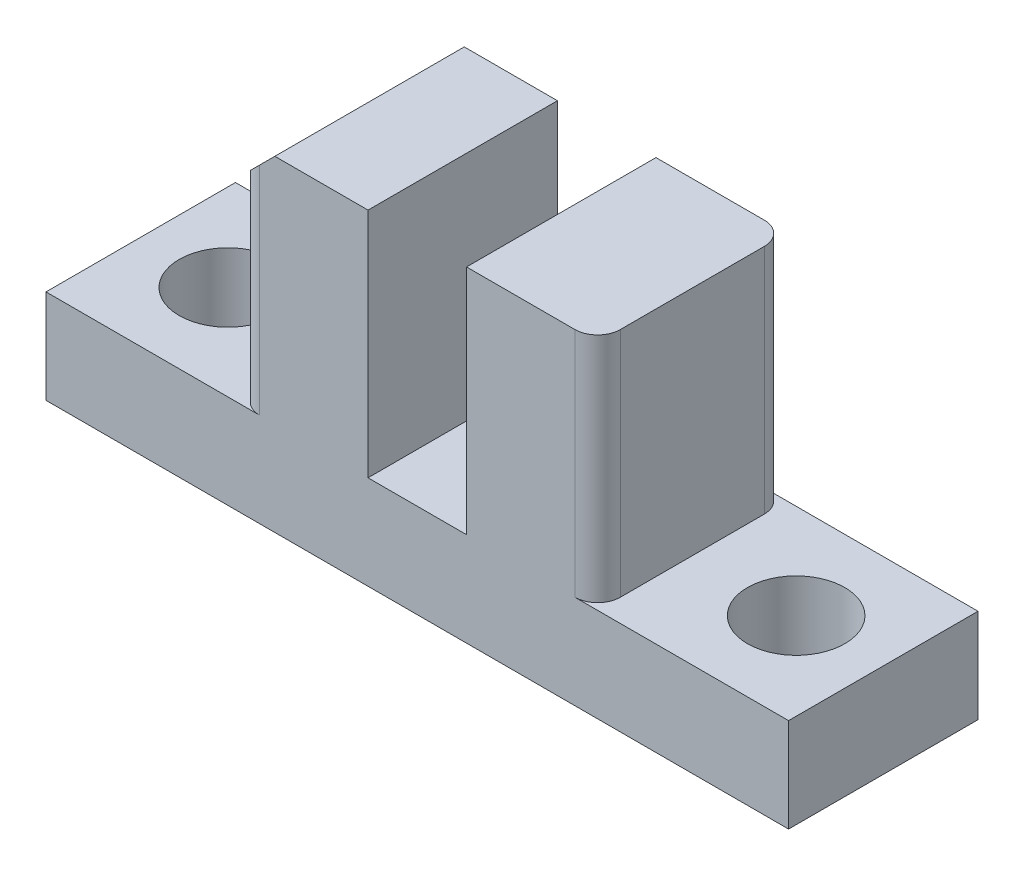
ISO-10303-21;
HEADER;
FILE_DESCRIPTION(('STEP AP214'),'2;1');
FILE_NAME('part.step','',(''),(''),'','','');
FILE_SCHEMA(('AUTOMOTIVE_DESIGN { 1 0 10303 214 1 1 1 1 }'));
ENDSEC;
DATA;
#1=APPLICATION_CONTEXT('core data for automotive mechanical design processes');
#2=APPLICATION_PROTOCOL_DEFINITION('international standard','automotive_design',2000,#1);
#3=PRODUCT_CONTEXT('',#1,'mechanical');
#4=PRODUCT('Part','Part','',(#3));
#5=PRODUCT_RELATED_PRODUCT_CATEGORY('part','',(#4));
#6=PRODUCT_DEFINITION_FORMATION('','',#4);
#7=PRODUCT_DEFINITION_CONTEXT('part definition',#1,'design');
#8=PRODUCT_DEFINITION('design','',#6,#7);
#9=PRODUCT_DEFINITION_SHAPE('','',#8);
#10=(LENGTH_UNIT() NAMED_UNIT(*) SI_UNIT(.MILLI.,.METRE.));
#11=(NAMED_UNIT(*) PLANE_ANGLE_UNIT() SI_UNIT($,.RADIAN.));
#12=(NAMED_UNIT(*) SI_UNIT($,.STERADIAN.) SOLID_ANGLE_UNIT());
#13=UNCERTAINTY_MEASURE_WITH_UNIT(LENGTH_MEASURE(1.E-05),#10,'distance_accuracy_value','');
#14=(GEOMETRIC_REPRESENTATION_CONTEXT(3) GLOBAL_UNCERTAINTY_ASSIGNED_CONTEXT((#13)) GLOBAL_UNIT_ASSIGNED_CONTEXT((#10,
#11,#12)) REPRESENTATION_CONTEXT('',''));
#15=CARTESIAN_POINT('',(0.,0.,0.));
#16=DIRECTION('',(0.,0.,1.));
#17=DIRECTION('',(1.,0.,0.));
#18=AXIS2_PLACEMENT_3D('',#15,#16,#17);
#19=CARTESIAN_POINT('',(-6.04519999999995,10.922,6.35));
#20=DIRECTION('',(1.,0.,0.));
#21=DIRECTION('',(0.,1.,0.));
#22=AXIS2_PLACEMENT_3D('',#19,#20,#21);
#23=PLANE('',#22);
#24=DIRECTION('',(0.,0.,-1.));
#25=VECTOR('',#24,1.);
#26=CARTESIAN_POINT('',(-6.04519999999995,9.65199999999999,6.35));
#27=LINE('',#26,#25);
#28=CARTESIAN_POINT('',(-6.04519999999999,9.65199999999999,5.588));
#29=VERTEX_POINT('',#28);
#30=CARTESIAN_POINT('',(-6.0452,9.65199999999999,0.762));
#31=VERTEX_POINT('',#30);
#32=EDGE_CURVE('E237',#29,#31,#27,.T.);
#33=ORIENTED_EDGE('',*,*,#32,.T.);
#34=DIRECTION('',(0.,-1.,0.));
#35=VECTOR('',#34,1.);
#36=CARTESIAN_POINT('',(-6.0452,10.922,0.762));
#37=LINE('',#36,#35);
#38=CARTESIAN_POINT('',(-6.0452,3.1496,0.762000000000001));
#39=VERTEX_POINT('',#38);
#40=EDGE_CURVE('E266',#31,#39,#37,.T.);
#41=ORIENTED_EDGE('',*,*,#40,.T.);
#42=DIRECTION('',(0.,0.,-1.));
#43=VECTOR('',#42,1.);
#44=CARTESIAN_POINT('',(-6.04519999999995,3.1496,6.35));
#45=LINE('',#44,#43);
#46=CARTESIAN_POINT('',(-6.04519999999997,3.1496,5.588));
#47=VERTEX_POINT('',#46);
#48=EDGE_CURVE('E165',#47,#39,#45,.T.);
#49=ORIENTED_EDGE('',*,*,#48,.F.);
#50=DIRECTION('',(0.,-1.,0.));
#51=VECTOR('',#50,1.);
#52=CARTESIAN_POINT('',(-6.04519999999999,9.65200000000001,5.588));
#53=LINE('',#52,#51);
#54=EDGE_CURVE('E264',#47,#29,#53,.F.);
#55=ORIENTED_EDGE('',*,*,#54,.T.);
#56=EDGE_LOOP('',(#33,#41,#49,#55));
#57=FACE_BOUND('',#56,.T.);
#58=ADVANCED_FACE('F30',(#57),#23,.F.);
#59=CARTESIAN_POINT('',(-12.4459999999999,3.1496,6.35));
#60=DIRECTION('',(0.,-1.,0.));
#61=DIRECTION('',(0.,0.,-1.));
#62=AXIS2_PLACEMENT_3D('',#59,#60,#61);
#63=PLANE('',#62);
#64=CARTESIAN_POINT('',(-9.52499999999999,3.1496,3.175));
#65=DIRECTION('',(0.,1.,0.));
#66=DIRECTION('',(0.,0.,1.));
#67=AXIS2_PLACEMENT_3D('',#64,#65,#66);
#68=CIRCLE('',#67,1.63194999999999);
#69=CARTESIAN_POINT('',(-9.52499999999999,3.1496,4.80694999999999));
#70=VERTEX_POINT('',#69);
#71=EDGE_CURVE('E523',#70,#70,#68,.T.);
#72=ORIENTED_EDGE('',*,*,#71,.F.);
#73=EDGE_LOOP('',(#72));
#74=FACE_BOUND('',#73,.T.);
#75=DIRECTION('',(-1.,0.,0.));
#76=VECTOR('',#75,1.);
#77=CARTESIAN_POINT('',(-12.446,3.1496,0.));
#78=LINE('',#77,#76);
#79=CARTESIAN_POINT('',(-5.2832,3.1496,0.));
#80=VERTEX_POINT('',#79);
#81=CARTESIAN_POINT('',(-12.446,3.1496,0.));
#82=VERTEX_POINT('',#81);
#83=EDGE_CURVE('E162',#80,#82,#78,.T.);
#84=ORIENTED_EDGE('',*,*,#83,.T.);
#85=DIRECTION('',(0.,0.,-1.));
#86=VECTOR('',#85,1.);
#87=CARTESIAN_POINT('',(-12.4459999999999,3.1496,6.35));
#88=LINE('',#87,#86);
#89=CARTESIAN_POINT('',(-12.4459999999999,3.1496,6.35));
#90=VERTEX_POINT('',#89);
#91=EDGE_CURVE('E160',#90,#82,#88,.T.);
#92=ORIENTED_EDGE('',*,*,#91,.F.);
#93=DIRECTION('',(-1.,0.,0.));
#94=VECTOR('',#93,1.);
#95=CARTESIAN_POINT('',(-12.4459999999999,3.1496,6.35));
#96=LINE('',#95,#94);
#97=CARTESIAN_POINT('',(-5.28319999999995,3.1496,6.35));
#98=VERTEX_POINT('',#97);
#99=EDGE_CURVE('E148',#98,#90,#96,.T.);
#100=ORIENTED_EDGE('',*,*,#99,.F.);
#101=CARTESIAN_POINT('',(-5.28319999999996,3.1496,5.588));
#102=DIRECTION('',(0.,-1.,0.));
#103=DIRECTION('',(0.,0.,-1.));
#104=AXIS2_PLACEMENT_3D('',#101,#102,#103);
#105=CIRCLE('',#104,0.762);
#106=EDGE_CURVE('E11',#98,#47,#105,.T.);
#107=ORIENTED_EDGE('',*,*,#106,.T.);
#108=ORIENTED_EDGE('',*,*,#48,.T.);
#109=CARTESIAN_POINT('',(-5.2832,3.1496,0.762));
#110=DIRECTION('',(0.,-1.,0.));
#111=DIRECTION('',(0.,0.,-1.));
#112=AXIS2_PLACEMENT_3D('',#109,#110,#111);
#113=CIRCLE('',#112,0.762);
#114=EDGE_CURVE('E38',#39,#80,#113,.T.);
#115=ORIENTED_EDGE('',*,*,#114,.T.);
#116=EDGE_LOOP('',(#84,#92,#100,#107,#108,#115));
#117=FACE_BOUND('',#116,.T.);
#118=ADVANCED_FACE('F161',(#74,#117),#63,.F.);
#119=CARTESIAN_POINT('',(-12.4459999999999,0.,6.35));
#120=DIRECTION('',(1.,0.,0.));
#121=DIRECTION('',(0.,0.,-1.));
#122=AXIS2_PLACEMENT_3D('',#119,#120,#121);
#123=PLANE('',#122);
#124=DIRECTION('',(0.,-1.,0.));
#125=VECTOR('',#124,1.);
#126=CARTESIAN_POINT('',(-12.446,0.,0.));
#127=LINE('',#126,#125);
#128=CARTESIAN_POINT('',(-12.446,0.,0.));
#129=VERTEX_POINT('',#128);
#130=EDGE_CURVE('E193',#82,#129,#127,.T.);
#131=ORIENTED_EDGE('',*,*,#130,.T.);
#132=DIRECTION('',(0.,0.,-1.));
#133=VECTOR('',#132,1.);
#134=CARTESIAN_POINT('',(-12.4459999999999,0.,6.35));
#135=LINE('',#134,#133);
#136=CARTESIAN_POINT('',(-12.4459999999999,0.,6.35));
#137=VERTEX_POINT('',#136);
#138=EDGE_CURVE('E166',#137,#129,#135,.T.);
#139=ORIENTED_EDGE('',*,*,#138,.F.);
#140=DIRECTION('',(0.,-1.,0.));
#141=VECTOR('',#140,1.);
#142=CARTESIAN_POINT('',(-12.4459999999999,0.,6.35));
#143=LINE('',#142,#141);
#144=EDGE_CURVE('E152',#90,#137,#143,.T.);
#145=ORIENTED_EDGE('',*,*,#144,.F.);
#146=ORIENTED_EDGE('',*,*,#91,.T.);
#147=EDGE_LOOP('',(#131,#139,#145,#146));
#148=FACE_BOUND('',#147,.T.);
#149=ADVANCED_FACE('F168',(#148),#123,.F.);
#150=CARTESIAN_POINT('',(-12.4459999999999,0.,6.35));
#151=DIRECTION('',(0.,1.,0.));
#152=DIRECTION('',(0.,0.,1.));
#153=AXIS2_PLACEMENT_3D('',#150,#151,#152);
#154=PLANE('',#153);
#155=CARTESIAN_POINT('',(-9.52499999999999,0.,3.175));
#156=DIRECTION('',(0.,1.,0.));
#157=DIRECTION('',(0.,0.,1.));
#158=AXIS2_PLACEMENT_3D('',#155,#156,#157);
#159=CIRCLE('',#158,1.63195);
#160=CARTESIAN_POINT('',(-9.52499999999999,0.,4.80695));
#161=VERTEX_POINT('',#160);
#162=EDGE_CURVE('E520',#161,#161,#159,.T.);
#163=ORIENTED_EDGE('',*,*,#162,.T.);
#164=EDGE_LOOP('',(#163));
#165=FACE_BOUND('',#164,.T.);
#166=CARTESIAN_POINT('',(9.52500000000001,0.,3.175));
#167=DIRECTION('',(0.,1.,0.));
#168=DIRECTION('',(0.,0.,1.));
#169=AXIS2_PLACEMENT_3D('',#166,#167,#168);
#170=CIRCLE('',#169,1.63195);
#171=CARTESIAN_POINT('',(9.52500000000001,0.,4.80695));
#172=VERTEX_POINT('',#171);
#173=EDGE_CURVE('E194',#172,#172,#170,.T.);
#174=ORIENTED_EDGE('',*,*,#173,.T.);
#175=EDGE_LOOP('',(#174));
#176=FACE_BOUND('',#175,.T.);
#177=DIRECTION('',(1.,0.,0.));
#178=VECTOR('',#177,1.);
#179=CARTESIAN_POINT('',(-12.446,0.,0.));
#180=LINE('',#179,#178);
#181=CARTESIAN_POINT('',(12.446,0.,0.));
#182=VERTEX_POINT('',#181);
#183=EDGE_CURVE('E196',#129,#182,#180,.T.);
#184=ORIENTED_EDGE('',*,*,#183,.T.);
#185=DIRECTION('',(0.,0.,-1.));
#186=VECTOR('',#185,1.);
#187=CARTESIAN_POINT('',(12.4460000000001,0.,6.35));
#188=LINE('',#187,#186);
#189=CARTESIAN_POINT('',(12.4460000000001,0.,6.35));
#190=VERTEX_POINT('',#189);
#191=EDGE_CURVE('E232',#190,#182,#188,.T.);
#192=ORIENTED_EDGE('',*,*,#191,.F.);
#193=DIRECTION('',(1.,0.,0.));
#194=VECTOR('',#193,1.);
#195=CARTESIAN_POINT('',(-12.4459999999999,0.,6.35));
#196=LINE('',#195,#194);
#197=EDGE_CURVE('E171',#137,#190,#196,.T.);
#198=ORIENTED_EDGE('',*,*,#197,.F.);
#199=ORIENTED_EDGE('',*,*,#138,.T.);
#200=EDGE_LOOP('',(#184,#192,#198,#199));
#201=FACE_BOUND('',#200,.T.);
#202=ADVANCED_FACE('F336',(#165,#176,#201),#154,.F.);
#203=CARTESIAN_POINT('',(12.4460000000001,0.,6.35));
#204=DIRECTION('',(-1.,0.,0.));
#205=DIRECTION('',(0.,0.,1.));
#206=AXIS2_PLACEMENT_3D('',#203,#204,#205);
#207=PLANE('',#206);
#208=DIRECTION('',(0.,1.,0.));
#209=VECTOR('',#208,1.);
#210=CARTESIAN_POINT('',(12.446,0.,0.));
#211=LINE('',#210,#209);
#212=CARTESIAN_POINT('',(12.446,3.1496,0.));
#213=VERTEX_POINT('',#212);
#214=EDGE_CURVE('E198',#182,#213,#211,.T.);
#215=ORIENTED_EDGE('',*,*,#214,.T.);
#216=DIRECTION('',(0.,0.,-1.));
#217=VECTOR('',#216,1.);
#218=CARTESIAN_POINT('',(12.4460000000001,3.1496,6.35));
#219=LINE('',#218,#217);
#220=CARTESIAN_POINT('',(12.4460000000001,3.1496,6.35));
#221=VERTEX_POINT('',#220);
#222=EDGE_CURVE('E229',#221,#213,#219,.T.);
#223=ORIENTED_EDGE('',*,*,#222,.F.);
#224=DIRECTION('',(0.,1.,0.));
#225=VECTOR('',#224,1.);
#226=CARTESIAN_POINT('',(12.4460000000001,0.,6.35));
#227=LINE('',#226,#225);
#228=EDGE_CURVE('E173',#190,#221,#227,.T.);
#229=ORIENTED_EDGE('',*,*,#228,.F.);
#230=ORIENTED_EDGE('',*,*,#191,.T.);
#231=EDGE_LOOP('',(#215,#223,#229,#230));
#232=FACE_BOUND('',#231,.T.);
#233=ADVANCED_FACE('F332',(#232),#207,.F.);
#234=CARTESIAN_POINT('',(6.04520000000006,3.1496,6.35));
#235=DIRECTION('',(0.,-1.,0.));
#236=DIRECTION('',(0.,0.,-1.));
#237=AXIS2_PLACEMENT_3D('',#234,#235,#236);
#238=PLANE('',#237);
#239=CARTESIAN_POINT('',(9.52500000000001,3.1496,3.175));
#240=DIRECTION('',(0.,1.,0.));
#241=DIRECTION('',(0.,0.,1.));
#242=AXIS2_PLACEMENT_3D('',#239,#240,#241);
#243=CIRCLE('',#242,1.63194999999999);
#244=CARTESIAN_POINT('',(9.52500000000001,3.1496,4.80694999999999));
#245=VERTEX_POINT('',#244);
#246=EDGE_CURVE('E518',#245,#245,#243,.T.);
#247=ORIENTED_EDGE('',*,*,#246,.F.);
#248=EDGE_LOOP('',(#247));
#249=FACE_BOUND('',#248,.T.);
#250=DIRECTION('',(-1.,0.,0.));
#251=VECTOR('',#250,1.);
#252=CARTESIAN_POINT('',(6.0452,3.1496,0.));
#253=LINE('',#252,#251);
#254=CARTESIAN_POINT('',(5.2832,3.1496,0.));
#255=VERTEX_POINT('',#254);
#256=EDGE_CURVE('E200',#213,#255,#253,.T.);
#257=ORIENTED_EDGE('',*,*,#256,.T.);
#258=CARTESIAN_POINT('',(5.2832,3.1496,0.762));
#259=DIRECTION('',(0.,-1.,0.));
#260=DIRECTION('',(0.,0.,-1.));
#261=AXIS2_PLACEMENT_3D('',#258,#259,#260);
#262=CIRCLE('',#261,0.762);
#263=CARTESIAN_POINT('',(6.0452,3.1496,0.762));
#264=VERTEX_POINT('',#263);
#265=EDGE_CURVE('E272',#255,#264,#262,.T.);
#266=ORIENTED_EDGE('',*,*,#265,.T.);
#267=DIRECTION('',(0.,0.,-1.));
#268=VECTOR('',#267,1.);
#269=CARTESIAN_POINT('',(6.04520000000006,3.1496,6.35));
#270=LINE('',#269,#268);
#271=CARTESIAN_POINT('',(6.04520000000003,3.1496,5.588));
#272=VERTEX_POINT('',#271);
#273=EDGE_CURVE('E226',#272,#264,#270,.T.);
#274=ORIENTED_EDGE('',*,*,#273,.F.);
#275=CARTESIAN_POINT('',(5.28320000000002,3.1496,5.588));
#276=DIRECTION('',(0.,-1.,0.));
#277=DIRECTION('',(0.,0.,-1.));
#278=AXIS2_PLACEMENT_3D('',#275,#276,#277);
#279=CIRCLE('',#278,0.762);
#280=CARTESIAN_POINT('',(5.28320000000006,3.1496,6.35));
#281=VERTEX_POINT('',#280);
#282=EDGE_CURVE('E274',#272,#281,#279,.T.);
#283=ORIENTED_EDGE('',*,*,#282,.T.);
#284=DIRECTION('',(-1.,0.,0.));
#285=VECTOR('',#284,1.);
#286=CARTESIAN_POINT('',(6.04520000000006,3.1496,6.35));
#287=LINE('',#286,#285);
#288=EDGE_CURVE('E178',#221,#281,#287,.T.);
#289=ORIENTED_EDGE('',*,*,#288,.F.);
#290=ORIENTED_EDGE('',*,*,#222,.T.);
#291=EDGE_LOOP('',(#257,#266,#274,#283,#289,#290));
#292=FACE_BOUND('',#291,.T.);
#293=ADVANCED_FACE('F318',(#249,#292),#238,.F.);
#294=CARTESIAN_POINT('',(6.04520000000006,10.922,6.35));
#295=DIRECTION('',(-1.,0.,0.));
#296=DIRECTION('',(0.,-1.,0.));
#297=AXIS2_PLACEMENT_3D('',#294,#295,#296);
#298=PLANE('',#297);
#299=ORIENTED_EDGE('',*,*,#273,.T.);
#300=DIRECTION('',(0.,1.,0.));
#301=VECTOR('',#300,1.);
#302=CARTESIAN_POINT('',(6.0452,10.922,0.762000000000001));
#303=LINE('',#302,#301);
#304=CARTESIAN_POINT('',(6.0452,10.922,0.762000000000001));
#305=VERTEX_POINT('',#304);
#306=EDGE_CURVE('E248',#264,#305,#303,.T.);
#307=ORIENTED_EDGE('',*,*,#306,.T.);
#308=DIRECTION('',(0.,0.,-1.));
#309=VECTOR('',#308,1.);
#310=CARTESIAN_POINT('',(6.04520000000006,10.922,6.35));
#311=LINE('',#310,#309);
#312=CARTESIAN_POINT('',(6.0452,10.922,5.588));
#313=VERTEX_POINT('',#312);
#314=EDGE_CURVE('E223',#313,#305,#311,.T.);
#315=ORIENTED_EDGE('',*,*,#314,.F.);
#316=DIRECTION('',(0.,1.,0.));
#317=VECTOR('',#316,1.);
#318=CARTESIAN_POINT('',(6.04520000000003,3.1496,5.588));
#319=LINE('',#318,#317);
#320=EDGE_CURVE('E246',#313,#272,#319,.F.);
#321=ORIENTED_EDGE('',*,*,#320,.T.);
#322=EDGE_LOOP('',(#299,#307,#315,#321));
#323=FACE_BOUND('',#322,.T.);
#324=ADVANCED_FACE('F321',(#323),#298,.F.);
#325=CARTESIAN_POINT('',(1.65100000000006,10.922,6.35));
#326=DIRECTION('',(0.,-1.,0.));
#327=DIRECTION('',(0.,0.,-1.));
#328=AXIS2_PLACEMENT_3D('',#325,#326,#327);
#329=PLANE('',#328);
#330=ORIENTED_EDGE('',*,*,#314,.T.);
#331=CARTESIAN_POINT('',(5.2832,10.922,0.762));
#332=DIRECTION('',(0.,-1.,0.));
#333=DIRECTION('',(0.,0.,-1.));
#334=AXIS2_PLACEMENT_3D('',#331,#332,#333);
#335=CIRCLE('',#334,0.762);
#336=CARTESIAN_POINT('',(5.2832,10.922,0.));
#337=VERTEX_POINT('',#336);
#338=EDGE_CURVE('E253',#305,#337,#335,.F.);
#339=ORIENTED_EDGE('',*,*,#338,.T.);
#340=DIRECTION('',(-1.,0.,0.));
#341=VECTOR('',#340,1.);
#342=CARTESIAN_POINT('',(1.651,10.922,0.));
#343=LINE('',#342,#341);
#344=CARTESIAN_POINT('',(1.651,10.922,0.));
#345=VERTEX_POINT('',#344);
#346=EDGE_CURVE('E202',#337,#345,#343,.T.);
#347=ORIENTED_EDGE('',*,*,#346,.T.);
#348=DIRECTION('',(0.,0.,-1.));
#349=VECTOR('',#348,1.);
#350=CARTESIAN_POINT('',(1.65100000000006,10.922,6.35));
#351=LINE('',#350,#349);
#352=CARTESIAN_POINT('',(1.65100000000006,10.922,6.35));
#353=VERTEX_POINT('',#352);
#354=EDGE_CURVE('E220',#353,#345,#351,.T.);
#355=ORIENTED_EDGE('',*,*,#354,.F.);
#356=DIRECTION('',(-1.,0.,0.));
#357=VECTOR('',#356,1.);
#358=CARTESIAN_POINT('',(1.65100000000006,10.922,6.35));
#359=LINE('',#358,#357);
#360=CARTESIAN_POINT('',(5.28320000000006,10.922,6.35));
#361=VERTEX_POINT('',#360);
#362=EDGE_CURVE('E180',#361,#353,#359,.T.);
#363=ORIENTED_EDGE('',*,*,#362,.F.);
#364=CARTESIAN_POINT('',(5.2832,10.922,5.588));
#365=DIRECTION('',(0.,-1.,0.));
#366=DIRECTION('',(0.,0.,-1.));
#367=AXIS2_PLACEMENT_3D('',#364,#365,#366);
#368=CIRCLE('',#367,0.762);
#369=EDGE_CURVE('E251',#361,#313,#368,.F.);
#370=ORIENTED_EDGE('',*,*,#369,.T.);
#371=EDGE_LOOP('',(#330,#339,#347,#355,#363,#370));
#372=FACE_BOUND('',#371,.T.);
#373=ADVANCED_FACE('F309',(#372),#329,.F.);
#374=CARTESIAN_POINT('',(1.65100000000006,10.922,6.35));
#375=DIRECTION('',(1.,0.,0.));
#376=DIRECTION('',(0.,0.,-1.));
#377=AXIS2_PLACEMENT_3D('',#374,#375,#376);
#378=PLANE('',#377);
#379=DIRECTION('',(0.,-1.,0.));
#380=VECTOR('',#379,1.);
#381=CARTESIAN_POINT('',(1.651,10.922,0.));
#382=LINE('',#381,#380);
#383=CARTESIAN_POINT('',(1.651,3.1496,0.));
#384=VERTEX_POINT('',#383);
#385=EDGE_CURVE('E204',#345,#384,#382,.T.);
#386=ORIENTED_EDGE('',*,*,#385,.T.);
#387=DIRECTION('',(0.,0.,-1.));
#388=VECTOR('',#387,1.);
#389=CARTESIAN_POINT('',(1.65100000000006,3.1496,6.35));
#390=LINE('',#389,#388);
#391=CARTESIAN_POINT('',(1.65100000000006,3.1496,6.35));
#392=VERTEX_POINT('',#391);
#393=EDGE_CURVE('E217',#392,#384,#390,.T.);
#394=ORIENTED_EDGE('',*,*,#393,.F.);
#395=DIRECTION('',(0.,-1.,0.));
#396=VECTOR('',#395,1.);
#397=CARTESIAN_POINT('',(1.65100000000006,10.922,6.35));
#398=LINE('',#397,#396);
#399=EDGE_CURVE('E182',#353,#392,#398,.T.);
#400=ORIENTED_EDGE('',*,*,#399,.F.);
#401=ORIENTED_EDGE('',*,*,#354,.T.);
#402=EDGE_LOOP('',(#386,#394,#400,#401));
#403=FACE_BOUND('',#402,.T.);
#404=ADVANCED_FACE('F305',(#403),#378,.F.);
#405=CARTESIAN_POINT('',(1.65100000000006,3.1496,6.35));
#406=DIRECTION('',(0.,-1.,0.));
#407=DIRECTION('',(0.,0.,-1.));
#408=AXIS2_PLACEMENT_3D('',#405,#406,#407);
#409=PLANE('',#408);
#410=DIRECTION('',(-1.,0.,0.));
#411=VECTOR('',#410,1.);
#412=CARTESIAN_POINT('',(1.651,3.1496,0.));
#413=LINE('',#412,#411);
#414=CARTESIAN_POINT('',(-1.651,3.1496,0.));
#415=VERTEX_POINT('',#414);
#416=EDGE_CURVE('E206',#384,#415,#413,.T.);
#417=ORIENTED_EDGE('',*,*,#416,.T.);
#418=DIRECTION('',(0.,0.,-1.));
#419=VECTOR('',#418,1.);
#420=CARTESIAN_POINT('',(-1.65099999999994,3.1496,6.35));
#421=LINE('',#420,#419);
#422=CARTESIAN_POINT('',(-1.65099999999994,3.1496,6.35));
#423=VERTEX_POINT('',#422);
#424=EDGE_CURVE('E214',#423,#415,#421,.T.);
#425=ORIENTED_EDGE('',*,*,#424,.F.);
#426=DIRECTION('',(-1.,0.,0.));
#427=VECTOR('',#426,1.);
#428=CARTESIAN_POINT('',(1.65100000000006,3.1496,6.35));
#429=LINE('',#428,#427);
#430=EDGE_CURVE('E184',#392,#423,#429,.T.);
#431=ORIENTED_EDGE('',*,*,#430,.F.);
#432=ORIENTED_EDGE('',*,*,#393,.T.);
#433=EDGE_LOOP('',(#417,#425,#431,#432));
#434=FACE_BOUND('',#433,.T.);
#435=ADVANCED_FACE('F301',(#434),#409,.F.);
#436=CARTESIAN_POINT('',(-1.65099999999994,3.1496,6.35));
#437=DIRECTION('',(-1.,0.,0.));
#438=DIRECTION('',(0.,0.,1.));
#439=AXIS2_PLACEMENT_3D('',#436,#437,#438);
#440=PLANE('',#439);
#441=DIRECTION('',(0.,1.,0.));
#442=VECTOR('',#441,1.);
#443=CARTESIAN_POINT('',(-1.651,3.1496,0.));
#444=LINE('',#443,#442);
#445=CARTESIAN_POINT('',(-1.651,10.922,0.));
#446=VERTEX_POINT('',#445);
#447=EDGE_CURVE('E208',#415,#446,#444,.T.);
#448=ORIENTED_EDGE('',*,*,#447,.T.);
#449=DIRECTION('',(0.,0.,-1.));
#450=VECTOR('',#449,1.);
#451=CARTESIAN_POINT('',(-1.65099999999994,10.922,6.35));
#452=LINE('',#451,#450);
#453=CARTESIAN_POINT('',(-1.65099999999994,10.922,6.35));
#454=VERTEX_POINT('',#453);
#455=EDGE_CURVE('E191',#454,#446,#452,.T.);
#456=ORIENTED_EDGE('',*,*,#455,.F.);
#457=DIRECTION('',(0.,1.,0.));
#458=VECTOR('',#457,1.);
#459=CARTESIAN_POINT('',(-1.65099999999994,3.1496,6.35));
#460=LINE('',#459,#458);
#461=EDGE_CURVE('E186',#423,#454,#460,.T.);
#462=ORIENTED_EDGE('',*,*,#461,.F.);
#463=ORIENTED_EDGE('',*,*,#424,.T.);
#464=EDGE_LOOP('',(#448,#456,#462,#463));
#465=FACE_BOUND('',#464,.T.);
#466=ADVANCED_FACE('F296',(#465),#440,.F.);
#467=CARTESIAN_POINT('',(-6.04519999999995,10.922,6.35));
#468=DIRECTION('',(0.,-1.,0.));
#469=DIRECTION('',(0.,0.,-1.));
#470=AXIS2_PLACEMENT_3D('',#467,#468,#469);
#471=PLANE('',#470);
#472=DIRECTION('',(-1.,0.,0.));
#473=VECTOR('',#472,1.);
#474=CARTESIAN_POINT('',(-6.0452,10.922,0.));
#475=LINE('',#474,#473);
#476=CARTESIAN_POINT('',(-4.77519999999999,10.922,0.));
#477=VERTEX_POINT('',#476);
#478=EDGE_CURVE('E157',#446,#477,#475,.T.);
#479=ORIENTED_EDGE('',*,*,#478,.T.);
#480=DIRECTION('',(0.,0.,1.));
#481=VECTOR('',#480,1.);
#482=CARTESIAN_POINT('',(-4.77519999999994,10.922,6.35));
#483=LINE('',#482,#481);
#484=CARTESIAN_POINT('',(-4.77519999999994,10.922,6.35));
#485=VERTEX_POINT('',#484);
#486=EDGE_CURVE('E242',#477,#485,#483,.T.);
#487=ORIENTED_EDGE('',*,*,#486,.T.);
#488=DIRECTION('',(-1.,0.,0.));
#489=VECTOR('',#488,1.);
#490=CARTESIAN_POINT('',(-6.04519999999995,10.922,6.35));
#491=LINE('',#490,#489);
#492=EDGE_CURVE('E188',#454,#485,#491,.T.);
#493=ORIENTED_EDGE('',*,*,#492,.F.);
#494=ORIENTED_EDGE('',*,*,#455,.T.);
#495=EDGE_LOOP('',(#479,#487,#493,#494));
#496=FACE_BOUND('',#495,.T.);
#497=ADVANCED_FACE('F290',(#496),#471,.F.);
#498=CARTESIAN_POINT('',(-6.04519999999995,3.1496,6.35));
#499=DIRECTION('',(0.,0.,1.));
#500=DIRECTION('',(1.,0.,0.));
#501=AXIS2_PLACEMENT_3D('',#498,#499,#500);
#502=PLANE('',#501);
#503=ORIENTED_EDGE('',*,*,#288,.T.);
#504=DIRECTION('',(0.,1.,0.));
#505=VECTOR('',#504,1.);
#506=CARTESIAN_POINT('',(5.28320000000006,10.922,6.35));
#507=LINE('',#506,#505);
#508=EDGE_CURVE('E261',#281,#361,#507,.T.);
#509=ORIENTED_EDGE('',*,*,#508,.T.);
#510=ORIENTED_EDGE('',*,*,#362,.T.);
#511=ORIENTED_EDGE('',*,*,#399,.T.);
#512=ORIENTED_EDGE('',*,*,#430,.T.);
#513=ORIENTED_EDGE('',*,*,#461,.T.);
#514=ORIENTED_EDGE('',*,*,#492,.T.);
#515=DIRECTION('',(0.707106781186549,0.707106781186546,0.));
#516=VECTOR('',#515,1.);
#517=CARTESIAN_POINT('',(-9.29639999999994,6.40080000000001,6.35));
#518=LINE('',#517,#516);
#519=CARTESIAN_POINT('',(-5.28319999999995,10.414,6.35));
#520=VERTEX_POINT('',#519);
#521=EDGE_CURVE('E244',#485,#520,#518,.F.);
#522=ORIENTED_EDGE('',*,*,#521,.T.);
#523=DIRECTION('',(0.,-1.,0.));
#524=VECTOR('',#523,1.);
#525=CARTESIAN_POINT('',(-5.28319999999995,3.1496,6.35));
#526=LINE('',#525,#524);
#527=EDGE_CURVE('E156',#520,#98,#526,.T.);
#528=ORIENTED_EDGE('',*,*,#527,.T.);
#529=ORIENTED_EDGE('',*,*,#99,.T.);
#530=ORIENTED_EDGE('',*,*,#144,.T.);
#531=ORIENTED_EDGE('',*,*,#197,.T.);
#532=ORIENTED_EDGE('',*,*,#228,.T.);
#533=EDGE_LOOP('',(#503,#509,#510,#511,#512,#513,#514,#522,#528,#529,#530,#531,#532));
#534=FACE_BOUND('',#533,.T.);
#535=ADVANCED_FACE('F150',(#534),#502,.T.);
#536=CARTESIAN_POINT('',(-6.0452,3.1496,0.));
#537=DIRECTION('',(0.,0.,1.));
#538=DIRECTION('',(1.,0.,0.));
#539=AXIS2_PLACEMENT_3D('',#536,#537,#538);
#540=PLANE('',#539);
#541=ORIENTED_EDGE('',*,*,#346,.F.);
#542=DIRECTION('',(0.,1.,0.));
#543=VECTOR('',#542,1.);
#544=CARTESIAN_POINT('',(5.2832,3.1496,0.));
#545=LINE('',#544,#543);
#546=EDGE_CURVE('E257',#337,#255,#545,.F.);
#547=ORIENTED_EDGE('',*,*,#546,.T.);
#548=ORIENTED_EDGE('',*,*,#256,.F.);
#549=ORIENTED_EDGE('',*,*,#214,.F.);
#550=ORIENTED_EDGE('',*,*,#183,.F.);
#551=ORIENTED_EDGE('',*,*,#130,.F.);
#552=ORIENTED_EDGE('',*,*,#83,.F.);
#553=DIRECTION('',(0.,-1.,0.));
#554=VECTOR('',#553,1.);
#555=CARTESIAN_POINT('',(-5.2832,3.1496,0.));
#556=LINE('',#555,#554);
#557=CARTESIAN_POINT('',(-5.2832,10.414,0.));
#558=VERTEX_POINT('',#557);
#559=EDGE_CURVE('E255',#80,#558,#556,.F.);
#560=ORIENTED_EDGE('',*,*,#559,.T.);
#561=DIRECTION('',(-0.707106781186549,-0.707106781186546,0.));
#562=VECTOR('',#561,1.);
#563=CARTESIAN_POINT('',(-6.0452,9.65199999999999,0.));
#564=LINE('',#563,#562);
#565=EDGE_CURVE('E240',#558,#477,#564,.F.);
#566=ORIENTED_EDGE('',*,*,#565,.T.);
#567=ORIENTED_EDGE('',*,*,#478,.F.);
#568=ORIENTED_EDGE('',*,*,#447,.F.);
#569=ORIENTED_EDGE('',*,*,#416,.F.);
#570=ORIENTED_EDGE('',*,*,#385,.F.);
#571=EDGE_LOOP('',(#541,#547,#548,#549,#550,#551,#552,#560,#566,#567,#568,#569,#570));
#572=FACE_BOUND('',#571,.T.);
#573=ADVANCED_FACE('F281',(#572),#540,.F.);
#574=CARTESIAN_POINT('',(-6.04519999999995,9.65199999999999,6.35));
#575=DIRECTION('',(0.707106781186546,-0.707106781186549,0.));
#576=DIRECTION('',(0.707106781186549,0.707106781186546,0.));
#577=AXIS2_PLACEMENT_3D('',#574,#575,#576);
#578=PLANE('',#577);
#579=ORIENTED_EDGE('',*,*,#565,.F.);
#580=CARTESIAN_POINT('',(-5.2832,10.414,0.762));
#581=DIRECTION('',(0.707106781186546,-0.707106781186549,0.));
#582=DIRECTION('',(-0.707106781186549,-0.707106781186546,0.));
#583=AXIS2_PLACEMENT_3D('',#580,#581,#582);
#584=ELLIPSE('',#583,1.0776307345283,0.762);
#585=EDGE_CURVE('E270',#558,#31,#584,.F.);
#586=ORIENTED_EDGE('',*,*,#585,.T.);
#587=ORIENTED_EDGE('',*,*,#32,.F.);
#588=CARTESIAN_POINT('',(-5.28319999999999,10.414,5.588));
#589=DIRECTION('',(0.707106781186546,-0.707106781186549,0.));
#590=DIRECTION('',(0.707106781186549,0.707106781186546,0.));
#591=AXIS2_PLACEMENT_3D('',#588,#589,#590);
#592=ELLIPSE('',#591,1.0776307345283,0.762);
#593=EDGE_CURVE('E268',#29,#520,#592,.F.);
#594=ORIENTED_EDGE('',*,*,#593,.T.);
#595=ORIENTED_EDGE('',*,*,#521,.F.);
#596=ORIENTED_EDGE('',*,*,#486,.F.);
#597=EDGE_LOOP('',(#579,#586,#587,#594,#595,#596));
#598=FACE_BOUND('',#597,.T.);
#599=ADVANCED_FACE('F285',(#598),#578,.F.);
#600=CARTESIAN_POINT('',(9.52500000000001,3.1496,3.175));
#601=DIRECTION('',(0.,1.,0.));
#602=DIRECTION('',(0.,0.,1.));
#603=AXIS2_PLACEMENT_3D('',#600,#601,#602);
#604=CYLINDRICAL_SURFACE('',#603,1.63194999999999);
#605=ORIENTED_EDGE('',*,*,#173,.F.);
#606=EDGE_LOOP('',(#605));
#607=FACE_BOUND('',#606,.T.);
#608=ORIENTED_EDGE('',*,*,#246,.T.);
#609=EDGE_LOOP('',(#608));
#610=FACE_BOUND('',#609,.T.);
#611=ADVANCED_FACE('F359',(#607,#610),#604,.F.);
#612=CARTESIAN_POINT('',(-9.52499999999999,3.1496,3.175));
#613=DIRECTION('',(0.,1.,0.));
#614=DIRECTION('',(0.,0.,1.));
#615=AXIS2_PLACEMENT_3D('',#612,#613,#614);
#616=CYLINDRICAL_SURFACE('',#615,1.63194999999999);
#617=ORIENTED_EDGE('',*,*,#162,.F.);
#618=EDGE_LOOP('',(#617));
#619=FACE_BOUND('',#618,.T.);
#620=ORIENTED_EDGE('',*,*,#71,.T.);
#621=EDGE_LOOP('',(#620));
#622=FACE_BOUND('',#621,.T.);
#623=ADVANCED_FACE('F362',(#619,#622),#616,.F.);
#624=CARTESIAN_POINT('',(5.2832,10.922,0.762));
#625=DIRECTION('',(0.,1.,0.));
#626=DIRECTION('',(-1.,0.,0.));
#627=AXIS2_PLACEMENT_3D('',#624,#625,#626);
#628=CYLINDRICAL_SURFACE('',#627,0.762);
#629=ORIENTED_EDGE('',*,*,#265,.F.);
#630=ORIENTED_EDGE('',*,*,#546,.F.);
#631=ORIENTED_EDGE('',*,*,#338,.F.);
#632=ORIENTED_EDGE('',*,*,#306,.F.);
#633=EDGE_LOOP('',(#629,#630,#631,#632));
#634=FACE_BOUND('',#633,.T.);
#635=ADVANCED_FACE('F314',(#634),#628,.T.);
#636=CARTESIAN_POINT('',(5.28320000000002,3.1496,5.588));
#637=DIRECTION('',(0.,-1.,0.));
#638=DIRECTION('',(1.,0.,0.));
#639=AXIS2_PLACEMENT_3D('',#636,#637,#638);
#640=CYLINDRICAL_SURFACE('',#639,0.762);
#641=ORIENTED_EDGE('',*,*,#282,.F.);
#642=ORIENTED_EDGE('',*,*,#320,.F.);
#643=ORIENTED_EDGE('',*,*,#369,.F.);
#644=ORIENTED_EDGE('',*,*,#508,.F.);
#645=EDGE_LOOP('',(#641,#642,#643,#644));
#646=FACE_BOUND('',#645,.T.);
#647=ADVANCED_FACE('F325',(#646),#640,.T.);
#648=CARTESIAN_POINT('',(-5.2832,10.922,0.762));
#649=DIRECTION('',(0.,-1.,0.));
#650=DIRECTION('',(1.,0.,0.));
#651=AXIS2_PLACEMENT_3D('',#648,#649,#650);
#652=CYLINDRICAL_SURFACE('',#651,0.762);
#653=ORIENTED_EDGE('',*,*,#585,.F.);
#654=ORIENTED_EDGE('',*,*,#559,.F.);
#655=ORIENTED_EDGE('',*,*,#114,.F.);
#656=ORIENTED_EDGE('',*,*,#40,.F.);
#657=EDGE_LOOP('',(#653,#654,#655,#656));
#658=FACE_BOUND('',#657,.T.);
#659=ADVANCED_FACE('F277',(#658),#652,.T.);
#660=CARTESIAN_POINT('',(-5.28319999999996,3.1496,5.588));
#661=DIRECTION('',(0.,1.,0.));
#662=DIRECTION('',(-1.,0.,0.));
#663=AXIS2_PLACEMENT_3D('',#660,#661,#662);
#664=CYLINDRICAL_SURFACE('',#663,0.762);
#665=ORIENTED_EDGE('',*,*,#593,.F.);
#666=ORIENTED_EDGE('',*,*,#54,.F.);
#667=ORIENTED_EDGE('',*,*,#106,.F.);
#668=ORIENTED_EDGE('',*,*,#527,.F.);
#669=EDGE_LOOP('',(#665,#666,#667,#668));
#670=FACE_BOUND('',#669,.T.);
#671=ADVANCED_FACE('F32',(#670),#664,.T.);
#672=CLOSED_SHELL('',(#58,#118,#149,#202,#233,#293,#324,#373,#404,#435,#466,#497,#535,#573,#599,
#611,#623,#635,#647,#659,#671));
#673=MANIFOLD_SOLID_BREP('B2',#672);
#674=ADVANCED_BREP_SHAPE_REPRESENTATION('',(#18,#673),#14);
#675=SHAPE_DEFINITION_REPRESENTATION(#9,#674);
ENDSEC;
END-ISO-10303-21;
